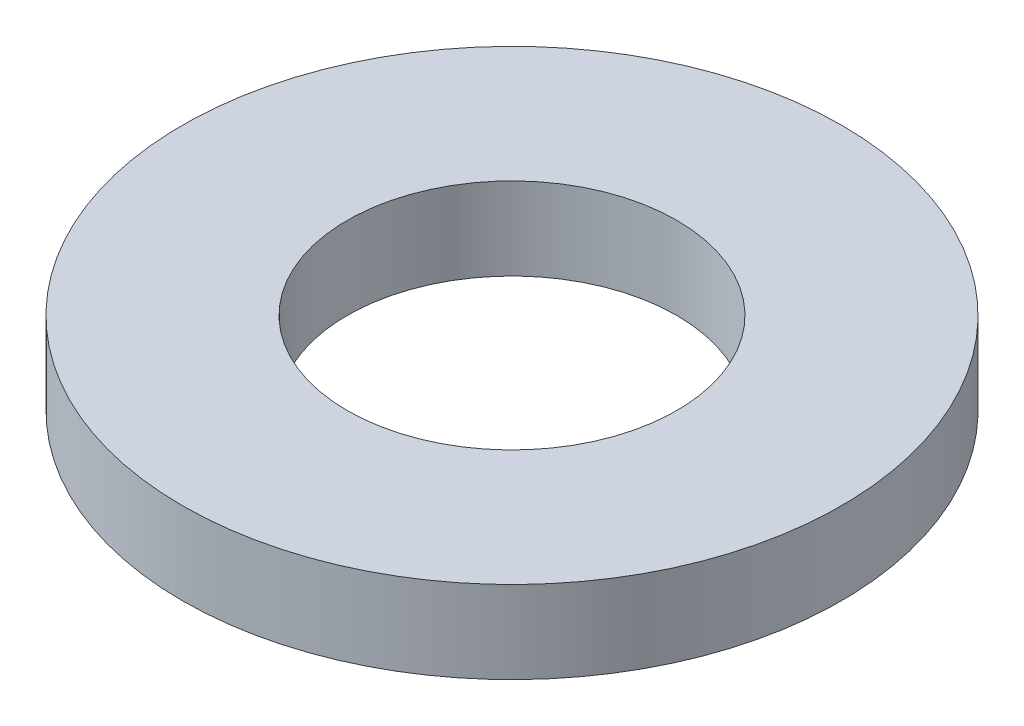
ISO-10303-21;
HEADER;
FILE_DESCRIPTION(('STEP AP214'),'2;1');
FILE_NAME('part.step','',(''),(''),'','','');
FILE_SCHEMA(('AUTOMOTIVE_DESIGN { 1 0 10303 214 1 1 1 1 }'));
ENDSEC;
DATA;
#1=APPLICATION_CONTEXT('core data for automotive mechanical design processes');
#2=APPLICATION_PROTOCOL_DEFINITION('international standard','automotive_design',2000,#1);
#3=PRODUCT_CONTEXT('',#1,'mechanical');
#4=PRODUCT('Part','Part','',(#3));
#5=PRODUCT_RELATED_PRODUCT_CATEGORY('part','',(#4));
#6=PRODUCT_DEFINITION_FORMATION('','',#4);
#7=PRODUCT_DEFINITION_CONTEXT('part definition',#1,'design');
#8=PRODUCT_DEFINITION('design','',#6,#7);
#9=PRODUCT_DEFINITION_SHAPE('','',#8);
#10=(LENGTH_UNIT() NAMED_UNIT(*) SI_UNIT(.MILLI.,.METRE.));
#11=(NAMED_UNIT(*) PLANE_ANGLE_UNIT() SI_UNIT($,.RADIAN.));
#12=(NAMED_UNIT(*) SI_UNIT($,.STERADIAN.) SOLID_ANGLE_UNIT());
#13=UNCERTAINTY_MEASURE_WITH_UNIT(LENGTH_MEASURE(1.E-05),#10,'distance_accuracy_value','');
#14=(GEOMETRIC_REPRESENTATION_CONTEXT(3) GLOBAL_UNCERTAINTY_ASSIGNED_CONTEXT((#13)) GLOBAL_UNIT_ASSIGNED_CONTEXT((#10,
#11,#12)) REPRESENTATION_CONTEXT('',''));
#15=CARTESIAN_POINT('',(0.,0.,0.));
#16=DIRECTION('',(0.,0.,1.));
#17=DIRECTION('',(1.,0.,0.));
#18=AXIS2_PLACEMENT_3D('',#15,#16,#17);
#19=CARTESIAN_POINT('',(0.,0.5,0.));
#20=DIRECTION('',(0.,1.,0.));
#21=DIRECTION('',(0.,0.,1.));
#22=AXIS2_PLACEMENT_3D('',#19,#20,#21);
#23=PLANE('',#22);
#24=CARTESIAN_POINT('',(0.,0.5,0.));
#25=DIRECTION('',(0.,1.,0.));
#26=DIRECTION('',(0.,0.,1.));
#27=AXIS2_PLACEMENT_3D('',#24,#25,#26);
#28=CIRCLE('',#27,2.);
#29=CARTESIAN_POINT('',(0.,0.5,2.));
#30=VERTEX_POINT('',#29);
#31=EDGE_CURVE('E10',#30,#30,#28,.T.);
#32=ORIENTED_EDGE('',*,*,#31,.T.);
#33=EDGE_LOOP('',(#32));
#34=FACE_BOUND('',#33,.T.);
#35=CARTESIAN_POINT('',(0.,0.5,0.));
#36=DIRECTION('',(0.,1.,0.));
#37=DIRECTION('',(0.,0.,1.));
#38=AXIS2_PLACEMENT_3D('',#35,#36,#37);
#39=CIRCLE('',#38,1.);
#40=CARTESIAN_POINT('',(0.,0.5,1.));
#41=VERTEX_POINT('',#40);
#42=EDGE_CURVE('E42',#41,#41,#39,.T.);
#43=ORIENTED_EDGE('',*,*,#42,.F.);
#44=EDGE_LOOP('',(#43));
#45=FACE_BOUND('',#44,.T.);
#46=ADVANCED_FACE('F31',(#34,#45),#23,.T.);
#47=CARTESIAN_POINT('',(0.,0.,0.));
#48=DIRECTION('',(0.,1.,0.));
#49=DIRECTION('',(0.,0.,1.));
#50=AXIS2_PLACEMENT_3D('',#47,#48,#49);
#51=PLANE('',#50);
#52=CARTESIAN_POINT('',(0.,0.,0.));
#53=DIRECTION('',(0.,1.,0.));
#54=DIRECTION('',(0.,0.,1.));
#55=AXIS2_PLACEMENT_3D('',#52,#53,#54);
#56=CIRCLE('',#55,2.);
#57=CARTESIAN_POINT('',(0.,0.,2.));
#58=VERTEX_POINT('',#57);
#59=EDGE_CURVE('E35',#58,#58,#56,.T.);
#60=ORIENTED_EDGE('',*,*,#59,.F.);
#61=EDGE_LOOP('',(#60));
#62=FACE_BOUND('',#61,.T.);
#63=CARTESIAN_POINT('',(0.,0.,0.));
#64=DIRECTION('',(0.,1.,0.));
#65=DIRECTION('',(0.,0.,1.));
#66=AXIS2_PLACEMENT_3D('',#63,#64,#65);
#67=CIRCLE('',#66,1.);
#68=CARTESIAN_POINT('',(0.,0.,1.));
#69=VERTEX_POINT('',#68);
#70=EDGE_CURVE('E44',#69,#69,#67,.T.);
#71=ORIENTED_EDGE('',*,*,#70,.T.);
#72=EDGE_LOOP('',(#71));
#73=FACE_BOUND('',#72,.T.);
#74=ADVANCED_FACE('F54',(#62,#73),#51,.F.);
#75=CARTESIAN_POINT('',(0.,0.5,0.));
#76=DIRECTION('',(0.,-1.,0.));
#77=DIRECTION('',(0.,0.,-1.));
#78=AXIS2_PLACEMENT_3D('',#75,#76,#77);
#79=CYLINDRICAL_SURFACE('',#78,2.);
#80=ORIENTED_EDGE('',*,*,#31,.F.);
#81=EDGE_LOOP('',(#80));
#82=FACE_BOUND('',#81,.T.);
#83=ORIENTED_EDGE('',*,*,#59,.T.);
#84=EDGE_LOOP('',(#83));
#85=FACE_BOUND('',#84,.T.);
#86=ADVANCED_FACE('F33',(#82,#85),#79,.T.);
#87=CARTESIAN_POINT('',(0.,0.5,0.));
#88=DIRECTION('',(0.,-1.,0.));
#89=DIRECTION('',(0.,0.,-1.));
#90=AXIS2_PLACEMENT_3D('',#87,#88,#89);
#91=CYLINDRICAL_SURFACE('',#90,1.);
#92=ORIENTED_EDGE('',*,*,#42,.T.);
#93=EDGE_LOOP('',(#92));
#94=FACE_BOUND('',#93,.T.);
#95=ORIENTED_EDGE('',*,*,#70,.F.);
#96=EDGE_LOOP('',(#95));
#97=FACE_BOUND('',#96,.T.);
#98=ADVANCED_FACE('F50',(#94,#97),#91,.F.);
#99=CLOSED_SHELL('',(#46,#74,#86,#98));
#100=MANIFOLD_SOLID_BREP('B2',#99);
#101=ADVANCED_BREP_SHAPE_REPRESENTATION('',(#18,#100),#14);
#102=SHAPE_DEFINITION_REPRESENTATION(#9,#101);
ENDSEC;
END-ISO-10303-21;
